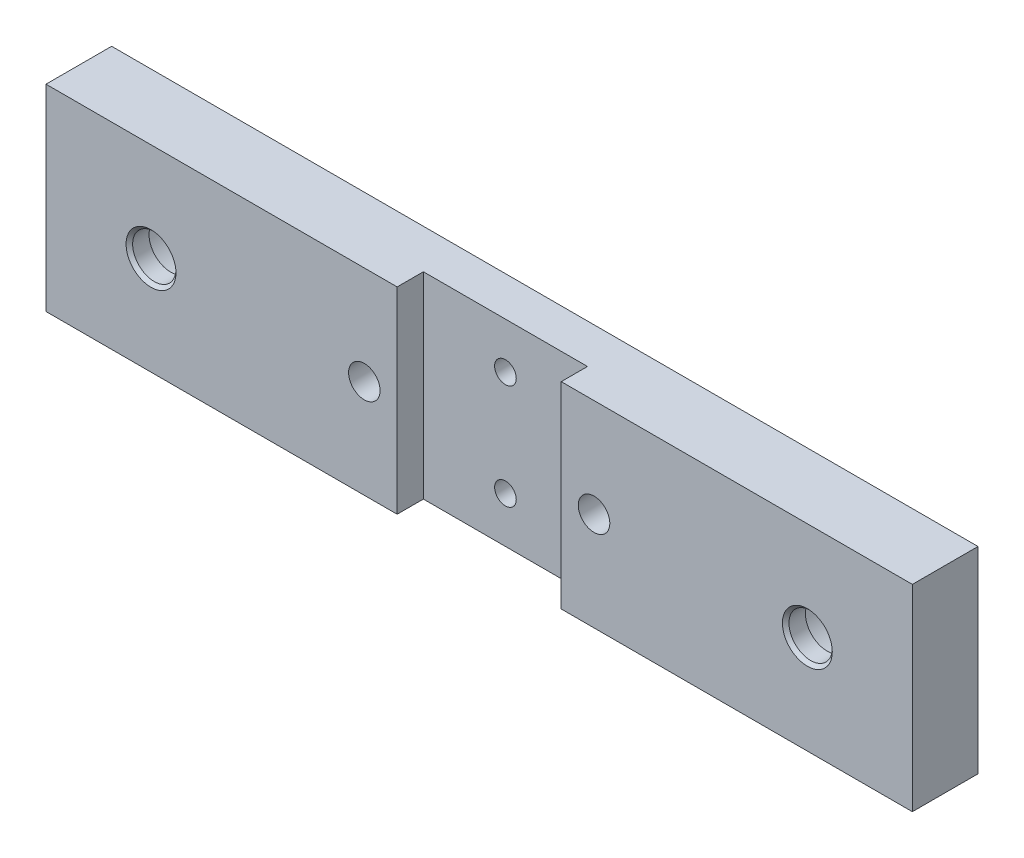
ISO-10303-21;
HEADER;
FILE_DESCRIPTION(('STEP AP214'),'2;1');
FILE_NAME('part.step','',(''),(''),'','','');
FILE_SCHEMA(('AUTOMOTIVE_DESIGN { 1 0 10303 214 1 1 1 1 }'));
ENDSEC;
DATA;
#1=APPLICATION_CONTEXT('core data for automotive mechanical design processes');
#2=APPLICATION_PROTOCOL_DEFINITION('international standard','automotive_design',2000,#1);
#3=PRODUCT_CONTEXT('',#1,'mechanical');
#4=PRODUCT('Part','Part','',(#3));
#5=PRODUCT_RELATED_PRODUCT_CATEGORY('part','',(#4));
#6=PRODUCT_DEFINITION_FORMATION('','',#4);
#7=PRODUCT_DEFINITION_CONTEXT('part definition',#1,'design');
#8=PRODUCT_DEFINITION('design','',#6,#7);
#9=PRODUCT_DEFINITION_SHAPE('','',#8);
#10=(LENGTH_UNIT() NAMED_UNIT(*) SI_UNIT(.MILLI.,.METRE.));
#11=(NAMED_UNIT(*) PLANE_ANGLE_UNIT() SI_UNIT($,.RADIAN.));
#12=(NAMED_UNIT(*) SI_UNIT($,.STERADIAN.) SOLID_ANGLE_UNIT());
#13=UNCERTAINTY_MEASURE_WITH_UNIT(LENGTH_MEASURE(1.E-05),#10,'distance_accuracy_value','');
#14=(GEOMETRIC_REPRESENTATION_CONTEXT(3) GLOBAL_UNCERTAINTY_ASSIGNED_CONTEXT((#13)) GLOBAL_UNIT_ASSIGNED_CONTEXT((#10,
#11,#12)) REPRESENTATION_CONTEXT('',''));
#15=CARTESIAN_POINT('',(0.,0.,0.));
#16=DIRECTION('',(0.,0.,1.));
#17=DIRECTION('',(1.,0.,0.));
#18=AXIS2_PLACEMENT_3D('',#15,#16,#17);
#19=CARTESIAN_POINT('',(-66.,-15.,10.));
#20=DIRECTION('',(0.,0.,1.));
#21=DIRECTION('',(1.,0.,0.));
#22=AXIS2_PLACEMENT_3D('',#19,#20,#21);
#23=PLANE('',#22);
#24=DIRECTION('',(0.,-1.,0.));
#25=VECTOR('',#24,1.);
#26=CARTESIAN_POINT('',(-12.5,-15.,10.));
#27=LINE('',#26,#25);
#28=CARTESIAN_POINT('',(-12.5,15.,10.));
#29=VERTEX_POINT('',#28);
#30=CARTESIAN_POINT('',(-12.5,-15.,10.));
#31=VERTEX_POINT('',#30);
#32=EDGE_CURVE('E103',#29,#31,#27,.T.);
#33=ORIENTED_EDGE('',*,*,#32,.F.);
#34=DIRECTION('',(-1.,0.,0.));
#35=VECTOR('',#34,1.);
#36=CARTESIAN_POINT('',(-66.,15.,10.));
#37=LINE('',#36,#35);
#38=CARTESIAN_POINT('',(-66.,15.,10.));
#39=VERTEX_POINT('',#38);
#40=EDGE_CURVE('E53',#29,#39,#37,.T.);
#41=ORIENTED_EDGE('',*,*,#40,.T.);
#42=DIRECTION('',(0.,-1.,0.));
#43=VECTOR('',#42,1.);
#44=CARTESIAN_POINT('',(-66.,15.,10.));
#45=LINE('',#44,#43);
#46=CARTESIAN_POINT('',(-66.,-15.,10.));
#47=VERTEX_POINT('',#46);
#48=EDGE_CURVE('E214',#39,#47,#45,.T.);
#49=ORIENTED_EDGE('',*,*,#48,.T.);
#50=DIRECTION('',(1.,0.,0.));
#51=VECTOR('',#50,1.);
#52=CARTESIAN_POINT('',(-66.,-15.,10.));
#53=LINE('',#52,#51);
#54=EDGE_CURVE('E216',#47,#31,#53,.T.);
#55=ORIENTED_EDGE('',*,*,#54,.T.);
#56=EDGE_LOOP('',(#33,#41,#49,#55));
#57=FACE_BOUND('',#56,.T.);
#58=CARTESIAN_POINT('',(-50.,0.,10.));
#59=DIRECTION('',(0.,0.,1.));
#60=DIRECTION('',(1.,0.,0.));
#61=AXIS2_PLACEMENT_3D('',#58,#59,#60);
#62=CIRCLE('',#61,3.8);
#63=CARTESIAN_POINT('',(-46.2,0.,10.));
#64=VERTEX_POINT('',#63);
#65=EDGE_CURVE('E137',#64,#64,#62,.F.);
#66=ORIENTED_EDGE('',*,*,#65,.T.);
#67=EDGE_LOOP('',(#66));
#68=FACE_BOUND('',#67,.T.);
#69=CARTESIAN_POINT('',(-17.5,0.,10.));
#70=DIRECTION('',(0.,0.,-1.));
#71=DIRECTION('',(-1.,0.,0.));
#72=AXIS2_PLACEMENT_3D('',#69,#70,#71);
#73=CIRCLE('',#72,2.4);
#74=CARTESIAN_POINT('',(-19.9,0.,10.));
#75=VERTEX_POINT('',#74);
#76=EDGE_CURVE('E158',#75,#75,#73,.T.);
#77=ORIENTED_EDGE('',*,*,#76,.T.);
#78=EDGE_LOOP('',(#77));
#79=FACE_BOUND('',#78,.T.);
#80=ADVANCED_FACE('F28',(#57,#68,#79),#23,.T.);
#81=DIRECTION('',(0.,1.,0.));
#82=VECTOR('',#81,1.);
#83=CARTESIAN_POINT('',(12.5,-15.,10.));
#84=LINE('',#83,#82);
#85=CARTESIAN_POINT('',(12.5,-15.,10.));
#86=VERTEX_POINT('',#85);
#87=CARTESIAN_POINT('',(12.5,15.,10.));
#88=VERTEX_POINT('',#87);
#89=EDGE_CURVE('E95',#86,#88,#84,.T.);
#90=ORIENTED_EDGE('',*,*,#89,.F.);
#91=CARTESIAN_POINT('',(66.,-15.,10.));
#92=VERTEX_POINT('',#91);
#93=EDGE_CURVE('E215',#86,#92,#53,.T.);
#94=ORIENTED_EDGE('',*,*,#93,.T.);
#95=DIRECTION('',(0.,1.,0.));
#96=VECTOR('',#95,1.);
#97=CARTESIAN_POINT('',(66.,15.,10.));
#98=LINE('',#97,#96);
#99=CARTESIAN_POINT('',(66.,15.,10.));
#100=VERTEX_POINT('',#99);
#101=EDGE_CURVE('E119',#92,#100,#98,.T.);
#102=ORIENTED_EDGE('',*,*,#101,.T.);
#103=EDGE_CURVE('E111',#100,#88,#37,.T.);
#104=ORIENTED_EDGE('',*,*,#103,.T.);
#105=EDGE_LOOP('',(#90,#94,#102,#104));
#106=FACE_BOUND('',#105,.T.);
#107=CARTESIAN_POINT('',(50.,0.,10.));
#108=DIRECTION('',(0.,0.,1.));
#109=DIRECTION('',(1.,0.,0.));
#110=AXIS2_PLACEMENT_3D('',#107,#108,#109);
#111=CIRCLE('',#110,3.8);
#112=CARTESIAN_POINT('',(53.8,0.,10.));
#113=VERTEX_POINT('',#112);
#114=EDGE_CURVE('E152',#113,#113,#111,.F.);
#115=ORIENTED_EDGE('',*,*,#114,.T.);
#116=EDGE_LOOP('',(#115));
#117=FACE_BOUND('',#116,.T.);
#118=CARTESIAN_POINT('',(17.5,0.,10.));
#119=DIRECTION('',(0.,0.,-1.));
#120=DIRECTION('',(-1.,0.,0.));
#121=AXIS2_PLACEMENT_3D('',#118,#119,#120);
#122=CIRCLE('',#121,2.4);
#123=CARTESIAN_POINT('',(15.1,0.,10.));
#124=VERTEX_POINT('',#123);
#125=EDGE_CURVE('E175',#124,#124,#122,.T.);
#126=ORIENTED_EDGE('',*,*,#125,.T.);
#127=EDGE_LOOP('',(#126));
#128=FACE_BOUND('',#127,.T.);
#129=ADVANCED_FACE('F116',(#106,#117,#128),#23,.T.);
#130=CARTESIAN_POINT('',(-66.,15.,10.));
#131=DIRECTION('',(1.,0.,0.));
#132=DIRECTION('',(0.,0.,-1.));
#133=AXIS2_PLACEMENT_3D('',#130,#131,#132);
#134=PLANE('',#133);
#135=DIRECTION('',(0.,-1.,0.));
#136=VECTOR('',#135,1.);
#137=CARTESIAN_POINT('',(-66.,15.,0.));
#138=LINE('',#137,#136);
#139=CARTESIAN_POINT('',(-66.,15.,0.));
#140=VERTEX_POINT('',#139);
#141=CARTESIAN_POINT('',(-66.,-15.,0.));
#142=VERTEX_POINT('',#141);
#143=EDGE_CURVE('E205',#140,#142,#138,.T.);
#144=ORIENTED_EDGE('',*,*,#143,.T.);
#145=DIRECTION('',(0.,0.,-1.));
#146=VECTOR('',#145,1.);
#147=CARTESIAN_POINT('',(-66.,-15.,10.));
#148=LINE('',#147,#146);
#149=EDGE_CURVE('E104',#47,#142,#148,.T.);
#150=ORIENTED_EDGE('',*,*,#149,.F.);
#151=ORIENTED_EDGE('',*,*,#48,.F.);
#152=DIRECTION('',(0.,0.,-1.));
#153=VECTOR('',#152,1.);
#154=CARTESIAN_POINT('',(-66.,15.,10.));
#155=LINE('',#154,#153);
#156=EDGE_CURVE('E121',#39,#140,#155,.T.);
#157=ORIENTED_EDGE('',*,*,#156,.T.);
#158=EDGE_LOOP('',(#144,#150,#151,#157));
#159=FACE_BOUND('',#158,.T.);
#160=ADVANCED_FACE('F30',(#159),#134,.F.);
#161=CARTESIAN_POINT('',(-66.,-15.,10.));
#162=DIRECTION('',(0.,1.,0.));
#163=DIRECTION('',(0.,0.,1.));
#164=AXIS2_PLACEMENT_3D('',#161,#162,#163);
#165=PLANE('',#164);
#166=DIRECTION('',(1.,0.,0.));
#167=VECTOR('',#166,1.);
#168=CARTESIAN_POINT('',(-66.,-15.,6.));
#169=LINE('',#168,#167);
#170=CARTESIAN_POINT('',(-12.5,-15.,6.));
#171=VERTEX_POINT('',#170);
#172=CARTESIAN_POINT('',(12.5,-15.,6.));
#173=VERTEX_POINT('',#172);
#174=EDGE_CURVE('E203',#171,#173,#169,.T.);
#175=ORIENTED_EDGE('',*,*,#174,.F.);
#176=DIRECTION('',(0.,0.,1.));
#177=VECTOR('',#176,1.);
#178=CARTESIAN_POINT('',(-12.5,-15.,10.));
#179=LINE('',#178,#177);
#180=EDGE_CURVE('E200',#171,#31,#179,.T.);
#181=ORIENTED_EDGE('',*,*,#180,.T.);
#182=ORIENTED_EDGE('',*,*,#54,.F.);
#183=ORIENTED_EDGE('',*,*,#149,.T.);
#184=DIRECTION('',(1.,0.,0.));
#185=VECTOR('',#184,1.);
#186=CARTESIAN_POINT('',(-66.,-15.,0.));
#187=LINE('',#186,#185);
#188=CARTESIAN_POINT('',(66.,-15.,0.));
#189=VERTEX_POINT('',#188);
#190=EDGE_CURVE('E208',#142,#189,#187,.T.);
#191=ORIENTED_EDGE('',*,*,#190,.T.);
#192=DIRECTION('',(0.,0.,-1.));
#193=VECTOR('',#192,1.);
#194=CARTESIAN_POINT('',(66.,-15.,10.));
#195=LINE('',#194,#193);
#196=EDGE_CURVE('E130',#92,#189,#195,.T.);
#197=ORIENTED_EDGE('',*,*,#196,.F.);
#198=ORIENTED_EDGE('',*,*,#93,.F.);
#199=DIRECTION('',(0.,0.,-1.));
#200=VECTOR('',#199,1.);
#201=CARTESIAN_POINT('',(12.5,-15.,10.));
#202=LINE('',#201,#200);
#203=EDGE_CURVE('E45',#86,#173,#202,.T.);
#204=ORIENTED_EDGE('',*,*,#203,.T.);
#205=EDGE_LOOP('',(#175,#181,#182,#183,#191,#197,#198,#204));
#206=FACE_BOUND('',#205,.T.);
#207=ADVANCED_FACE('F221',(#206),#165,.F.);
#208=CARTESIAN_POINT('',(66.,15.,10.));
#209=DIRECTION('',(-1.,0.,0.));
#210=DIRECTION('',(0.,0.,1.));
#211=AXIS2_PLACEMENT_3D('',#208,#209,#210);
#212=PLANE('',#211);
#213=DIRECTION('',(0.,1.,0.));
#214=VECTOR('',#213,1.);
#215=CARTESIAN_POINT('',(66.,15.,0.));
#216=LINE('',#215,#214);
#217=CARTESIAN_POINT('',(66.,15.,0.));
#218=VERTEX_POINT('',#217);
#219=EDGE_CURVE('E210',#189,#218,#216,.T.);
#220=ORIENTED_EDGE('',*,*,#219,.T.);
#221=DIRECTION('',(0.,0.,-1.));
#222=VECTOR('',#221,1.);
#223=CARTESIAN_POINT('',(66.,15.,10.));
#224=LINE('',#223,#222);
#225=EDGE_CURVE('E124',#100,#218,#224,.T.);
#226=ORIENTED_EDGE('',*,*,#225,.F.);
#227=ORIENTED_EDGE('',*,*,#101,.F.);
#228=ORIENTED_EDGE('',*,*,#196,.T.);
#229=EDGE_LOOP('',(#220,#226,#227,#228));
#230=FACE_BOUND('',#229,.T.);
#231=ADVANCED_FACE('F224',(#230),#212,.F.);
#232=CARTESIAN_POINT('',(-66.,15.,10.));
#233=DIRECTION('',(0.,-1.,0.));
#234=DIRECTION('',(0.,0.,-1.));
#235=AXIS2_PLACEMENT_3D('',#232,#233,#234);
#236=PLANE('',#235);
#237=ORIENTED_EDGE('',*,*,#40,.F.);
#238=DIRECTION('',(0.,0.,-1.));
#239=VECTOR('',#238,1.);
#240=CARTESIAN_POINT('',(-12.5,15.,10.));
#241=LINE('',#240,#239);
#242=CARTESIAN_POINT('',(-12.5,15.,6.));
#243=VERTEX_POINT('',#242);
#244=EDGE_CURVE('E198',#29,#243,#241,.T.);
#245=ORIENTED_EDGE('',*,*,#244,.T.);
#246=DIRECTION('',(-1.,0.,0.));
#247=VECTOR('',#246,1.);
#248=CARTESIAN_POINT('',(-66.,15.,6.));
#249=LINE('',#248,#247);
#250=CARTESIAN_POINT('',(12.5,15.,6.));
#251=VERTEX_POINT('',#250);
#252=EDGE_CURVE('E113',#251,#243,#249,.T.);
#253=ORIENTED_EDGE('',*,*,#252,.F.);
#254=DIRECTION('',(0.,0.,1.));
#255=VECTOR('',#254,1.);
#256=CARTESIAN_POINT('',(12.5,15.,10.));
#257=LINE('',#256,#255);
#258=EDGE_CURVE('E98',#251,#88,#257,.T.);
#259=ORIENTED_EDGE('',*,*,#258,.T.);
#260=ORIENTED_EDGE('',*,*,#103,.F.);
#261=ORIENTED_EDGE('',*,*,#225,.T.);
#262=DIRECTION('',(-1.,0.,0.));
#263=VECTOR('',#262,1.);
#264=CARTESIAN_POINT('',(-66.,15.,0.));
#265=LINE('',#264,#263);
#266=EDGE_CURVE('E212',#218,#140,#265,.T.);
#267=ORIENTED_EDGE('',*,*,#266,.T.);
#268=ORIENTED_EDGE('',*,*,#156,.F.);
#269=EDGE_LOOP('',(#237,#245,#253,#259,#260,#261,#267,#268));
#270=FACE_BOUND('',#269,.T.);
#271=ADVANCED_FACE('F109',(#270),#236,.F.);
#272=CARTESIAN_POINT('',(-66.,-15.,0.));
#273=DIRECTION('',(0.,0.,1.));
#274=DIRECTION('',(1.,0.,0.));
#275=AXIS2_PLACEMENT_3D('',#272,#273,#274);
#276=PLANE('',#275);
#277=CARTESIAN_POINT('',(0.,8.,0.));
#278=DIRECTION('',(0.,0.,-1.));
#279=DIRECTION('',(-1.,0.,0.));
#280=AXIS2_PLACEMENT_3D('',#277,#278,#279);
#281=CIRCLE('',#280,1.64999999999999);
#282=CARTESIAN_POINT('',(-1.64999999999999,8.,0.));
#283=VERTEX_POINT('',#282);
#284=EDGE_CURVE('E170',#283,#283,#281,.T.);
#285=ORIENTED_EDGE('',*,*,#284,.F.);
#286=EDGE_LOOP('',(#285));
#287=FACE_BOUND('',#286,.T.);
#288=CARTESIAN_POINT('',(0.,-8.,0.));
#289=DIRECTION('',(0.,0.,-1.));
#290=DIRECTION('',(-1.,0.,0.));
#291=AXIS2_PLACEMENT_3D('',#288,#289,#290);
#292=CIRCLE('',#291,1.64999999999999);
#293=CARTESIAN_POINT('',(-1.64999999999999,-8.,0.));
#294=VERTEX_POINT('',#293);
#295=EDGE_CURVE('E159',#294,#294,#292,.T.);
#296=ORIENTED_EDGE('',*,*,#295,.F.);
#297=EDGE_LOOP('',(#296));
#298=FACE_BOUND('',#297,.T.);
#299=CARTESIAN_POINT('',(-17.5,0.,0.));
#300=DIRECTION('',(0.,0.,-1.));
#301=DIRECTION('',(-1.,0.,0.));
#302=AXIS2_PLACEMENT_3D('',#299,#300,#301);
#303=CIRCLE('',#302,2.4);
#304=CARTESIAN_POINT('',(-19.9,0.,0.));
#305=VERTEX_POINT('',#304);
#306=EDGE_CURVE('E163',#305,#305,#303,.T.);
#307=ORIENTED_EDGE('',*,*,#306,.F.);
#308=EDGE_LOOP('',(#307));
#309=FACE_BOUND('',#308,.T.);
#310=CARTESIAN_POINT('',(17.5,0.,0.));
#311=DIRECTION('',(0.,0.,-1.));
#312=DIRECTION('',(-1.,0.,0.));
#313=AXIS2_PLACEMENT_3D('',#310,#311,#312);
#314=CIRCLE('',#313,2.4);
#315=CARTESIAN_POINT('',(15.1,0.,0.));
#316=VERTEX_POINT('',#315);
#317=EDGE_CURVE('E178',#316,#316,#314,.T.);
#318=ORIENTED_EDGE('',*,*,#317,.F.);
#319=EDGE_LOOP('',(#318));
#320=FACE_BOUND('',#319,.T.);
#321=CARTESIAN_POINT('',(-50.,0.,0.));
#322=DIRECTION('',(0.,0.,1.));
#323=DIRECTION('',(1.,0.,0.));
#324=AXIS2_PLACEMENT_3D('',#321,#322,#323);
#325=CIRCLE('',#324,6.75);
#326=CARTESIAN_POINT('',(-43.25,0.,0.));
#327=VERTEX_POINT('',#326);
#328=EDGE_CURVE('E149',#327,#327,#325,.T.);
#329=ORIENTED_EDGE('',*,*,#328,.T.);
#330=EDGE_LOOP('',(#329));
#331=FACE_BOUND('',#330,.T.);
#332=CARTESIAN_POINT('',(50.,0.,0.));
#333=DIRECTION('',(0.,0.,1.));
#334=DIRECTION('',(1.,0.,0.));
#335=AXIS2_PLACEMENT_3D('',#332,#333,#334);
#336=CIRCLE('',#335,6.75);
#337=CARTESIAN_POINT('',(56.75,0.,0.));
#338=VERTEX_POINT('',#337);
#339=EDGE_CURVE('E146',#338,#338,#336,.T.);
#340=ORIENTED_EDGE('',*,*,#339,.T.);
#341=EDGE_LOOP('',(#340));
#342=FACE_BOUND('',#341,.T.);
#343=ORIENTED_EDGE('',*,*,#143,.F.);
#344=ORIENTED_EDGE('',*,*,#266,.F.);
#345=ORIENTED_EDGE('',*,*,#219,.F.);
#346=ORIENTED_EDGE('',*,*,#190,.F.);
#347=EDGE_LOOP('',(#343,#344,#345,#346));
#348=FACE_BOUND('',#347,.T.);
#349=ADVANCED_FACE('F228',(#287,#298,#309,#320,#331,#342,#348),#276,.F.);
#350=CARTESIAN_POINT('',(-12.5,-31.9597267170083,6.));
#351=DIRECTION('',(0.,0.,1.));
#352=DIRECTION('',(1.,0.,0.));
#353=AXIS2_PLACEMENT_3D('',#350,#351,#352);
#354=PLANE('',#353);
#355=CARTESIAN_POINT('',(0.,8.,6.));
#356=DIRECTION('',(0.,0.,1.));
#357=DIRECTION('',(1.,0.,0.));
#358=AXIS2_PLACEMENT_3D('',#355,#356,#357);
#359=CIRCLE('',#358,1.64999999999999);
#360=CARTESIAN_POINT('',(1.64999999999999,8.,6.));
#361=VERTEX_POINT('',#360);
#362=EDGE_CURVE('E32',#361,#361,#359,.T.);
#363=ORIENTED_EDGE('',*,*,#362,.F.);
#364=EDGE_LOOP('',(#363));
#365=FACE_BOUND('',#364,.T.);
#366=CARTESIAN_POINT('',(0.,-8.,6.));
#367=DIRECTION('',(0.,0.,1.));
#368=DIRECTION('',(1.,0.,0.));
#369=AXIS2_PLACEMENT_3D('',#366,#367,#368);
#370=CIRCLE('',#369,1.64999999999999);
#371=CARTESIAN_POINT('',(1.64999999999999,-8.,6.));
#372=VERTEX_POINT('',#371);
#373=EDGE_CURVE('E156',#372,#372,#370,.T.);
#374=ORIENTED_EDGE('',*,*,#373,.F.);
#375=EDGE_LOOP('',(#374));
#376=FACE_BOUND('',#375,.T.);
#377=ORIENTED_EDGE('',*,*,#174,.T.);
#378=DIRECTION('',(0.,1.,0.));
#379=VECTOR('',#378,1.);
#380=CARTESIAN_POINT('',(12.5,31.326860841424,6.));
#381=LINE('',#380,#379);
#382=EDGE_CURVE('E114',#173,#251,#381,.T.);
#383=ORIENTED_EDGE('',*,*,#382,.T.);
#384=ORIENTED_EDGE('',*,*,#252,.T.);
#385=DIRECTION('',(0.,-1.,0.));
#386=VECTOR('',#385,1.);
#387=CARTESIAN_POINT('',(-12.5,31.326860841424,6.));
#388=LINE('',#387,#386);
#389=EDGE_CURVE('E193',#243,#171,#388,.T.);
#390=ORIENTED_EDGE('',*,*,#389,.T.);
#391=EDGE_LOOP('',(#377,#383,#384,#390));
#392=FACE_BOUND('',#391,.T.);
#393=ADVANCED_FACE('F252',(#365,#376,#392),#354,.T.);
#394=CARTESIAN_POINT('',(-12.5,31.326860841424,6.));
#395=DIRECTION('',(-1.,0.,0.));
#396=DIRECTION('',(0.,-1.,0.));
#397=AXIS2_PLACEMENT_3D('',#394,#395,#396);
#398=PLANE('',#397);
#399=ORIENTED_EDGE('',*,*,#389,.F.);
#400=ORIENTED_EDGE('',*,*,#244,.F.);
#401=ORIENTED_EDGE('',*,*,#32,.T.);
#402=ORIENTED_EDGE('',*,*,#180,.F.);
#403=EDGE_LOOP('',(#399,#400,#401,#402));
#404=FACE_BOUND('',#403,.T.);
#405=ADVANCED_FACE('F234',(#404),#398,.F.);
#406=CARTESIAN_POINT('',(12.5,31.326860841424,6.));
#407=DIRECTION('',(1.,0.,0.));
#408=DIRECTION('',(0.,1.,0.));
#409=AXIS2_PLACEMENT_3D('',#406,#407,#408);
#410=PLANE('',#409);
#411=ORIENTED_EDGE('',*,*,#89,.T.);
#412=ORIENTED_EDGE('',*,*,#258,.F.);
#413=ORIENTED_EDGE('',*,*,#382,.F.);
#414=ORIENTED_EDGE('',*,*,#203,.F.);
#415=EDGE_LOOP('',(#411,#412,#413,#414));
#416=FACE_BOUND('',#415,.T.);
#417=ADVANCED_FACE('F97',(#416),#410,.F.);
#418=CARTESIAN_POINT('',(50.,0.,0.));
#419=DIRECTION('',(0.,0.,-1.));
#420=DIRECTION('',(-1.,0.,0.));
#421=AXIS2_PLACEMENT_3D('',#418,#419,#420);
#422=CYLINDRICAL_SURFACE('',#421,3.3);
#423=CARTESIAN_POINT('',(50.,0.,9.5));
#424=DIRECTION('',(0.,0.,1.));
#425=DIRECTION('',(1.,0.,0.));
#426=AXIS2_PLACEMENT_3D('',#423,#424,#425);
#427=CIRCLE('',#426,3.3);
#428=CARTESIAN_POINT('',(53.3,0.,9.5));
#429=VERTEX_POINT('',#428);
#430=EDGE_CURVE('E37',#429,#429,#427,.T.);
#431=ORIENTED_EDGE('',*,*,#430,.T.);
#432=EDGE_LOOP('',(#431));
#433=FACE_BOUND('',#432,.T.);
#434=CARTESIAN_POINT('',(50.,0.,7.));
#435=DIRECTION('',(0.,0.,-1.));
#436=DIRECTION('',(-1.,0.,0.));
#437=AXIS2_PLACEMENT_3D('',#434,#435,#436);
#438=CIRCLE('',#437,3.3);
#439=CARTESIAN_POINT('',(46.7,0.,7.));
#440=VERTEX_POINT('',#439);
#441=EDGE_CURVE('E190',#440,#440,#438,.T.);
#442=ORIENTED_EDGE('',*,*,#441,.T.);
#443=EDGE_LOOP('',(#442));
#444=FACE_BOUND('',#443,.T.);
#445=ADVANCED_FACE('F277',(#433,#444),#422,.F.);
#446=CARTESIAN_POINT('',(53.3,0.,7.));
#447=DIRECTION('',(0.,0.,1.));
#448=DIRECTION('',(1.,0.,0.));
#449=AXIS2_PLACEMENT_3D('',#446,#447,#448);
#450=PLANE('',#449);
#451=ORIENTED_EDGE('',*,*,#441,.F.);
#452=EDGE_LOOP('',(#451));
#453=FACE_BOUND('',#452,.T.);
#454=CARTESIAN_POINT('',(50.,0.,7.));
#455=DIRECTION('',(0.,0.,-1.));
#456=DIRECTION('',(-1.,0.,0.));
#457=AXIS2_PLACEMENT_3D('',#454,#455,#456);
#458=CIRCLE('',#457,6.25);
#459=CARTESIAN_POINT('',(43.75,0.,7.));
#460=VERTEX_POINT('',#459);
#461=EDGE_CURVE('E187',#460,#460,#458,.T.);
#462=ORIENTED_EDGE('',*,*,#461,.T.);
#463=EDGE_LOOP('',(#462));
#464=FACE_BOUND('',#463,.T.);
#465=ADVANCED_FACE('F272',(#453,#464),#450,.F.);
#466=CARTESIAN_POINT('',(50.,0.,0.));
#467=DIRECTION('',(0.,0.,-1.));
#468=DIRECTION('',(-1.,0.,0.));
#469=AXIS2_PLACEMENT_3D('',#466,#467,#468);
#470=CYLINDRICAL_SURFACE('',#469,6.25);
#471=CARTESIAN_POINT('',(50.,0.,0.5));
#472=DIRECTION('',(0.,0.,1.));
#473=DIRECTION('',(1.,0.,0.));
#474=AXIS2_PLACEMENT_3D('',#471,#472,#473);
#475=CIRCLE('',#474,6.25);
#476=CARTESIAN_POINT('',(56.25,0.,0.5));
#477=VERTEX_POINT('',#476);
#478=EDGE_CURVE('E11',#477,#477,#475,.F.);
#479=ORIENTED_EDGE('',*,*,#478,.T.);
#480=EDGE_LOOP('',(#479));
#481=FACE_BOUND('',#480,.T.);
#482=ORIENTED_EDGE('',*,*,#461,.F.);
#483=EDGE_LOOP('',(#482));
#484=FACE_BOUND('',#483,.T.);
#485=ADVANCED_FACE('F268',(#481,#484),#470,.F.);
#486=CARTESIAN_POINT('',(-50.,0.,0.));
#487=DIRECTION('',(0.,0.,-1.));
#488=DIRECTION('',(-1.,0.,0.));
#489=AXIS2_PLACEMENT_3D('',#486,#487,#488);
#490=CYLINDRICAL_SURFACE('',#489,3.3);
#491=CARTESIAN_POINT('',(-50.,0.,9.5));
#492=DIRECTION('',(0.,0.,1.));
#493=DIRECTION('',(1.,0.,0.));
#494=AXIS2_PLACEMENT_3D('',#491,#492,#493);
#495=CIRCLE('',#494,3.3);
#496=CARTESIAN_POINT('',(-46.7,0.,9.5));
#497=VERTEX_POINT('',#496);
#498=EDGE_CURVE('E140',#497,#497,#495,.T.);
#499=ORIENTED_EDGE('',*,*,#498,.T.);
#500=EDGE_LOOP('',(#499));
#501=FACE_BOUND('',#500,.T.);
#502=CARTESIAN_POINT('',(-50.,0.,7.));
#503=DIRECTION('',(0.,0.,-1.));
#504=DIRECTION('',(-1.,0.,0.));
#505=AXIS2_PLACEMENT_3D('',#502,#503,#504);
#506=CIRCLE('',#505,3.3);
#507=CARTESIAN_POINT('',(-53.3,0.,7.));
#508=VERTEX_POINT('',#507);
#509=EDGE_CURVE('E184',#508,#508,#506,.T.);
#510=ORIENTED_EDGE('',*,*,#509,.T.);
#511=EDGE_LOOP('',(#510));
#512=FACE_BOUND('',#511,.T.);
#513=ADVANCED_FACE('F271',(#501,#512),#490,.F.);
#514=CARTESIAN_POINT('',(-46.7,0.,7.));
#515=DIRECTION('',(0.,0.,1.));
#516=DIRECTION('',(1.,0.,0.));
#517=AXIS2_PLACEMENT_3D('',#514,#515,#516);
#518=PLANE('',#517);
#519=ORIENTED_EDGE('',*,*,#509,.F.);
#520=EDGE_LOOP('',(#519));
#521=FACE_BOUND('',#520,.T.);
#522=CARTESIAN_POINT('',(-50.,0.,7.));
#523=DIRECTION('',(0.,0.,-1.));
#524=DIRECTION('',(-1.,0.,0.));
#525=AXIS2_PLACEMENT_3D('',#522,#523,#524);
#526=CIRCLE('',#525,6.25);
#527=CARTESIAN_POINT('',(-56.25,0.,7.));
#528=VERTEX_POINT('',#527);
#529=EDGE_CURVE('E181',#528,#528,#526,.T.);
#530=ORIENTED_EDGE('',*,*,#529,.T.);
#531=EDGE_LOOP('',(#530));
#532=FACE_BOUND('',#531,.T.);
#533=ADVANCED_FACE('F362',(#521,#532),#518,.F.);
#534=CARTESIAN_POINT('',(-50.,0.,0.));
#535=DIRECTION('',(0.,0.,-1.));
#536=DIRECTION('',(-1.,0.,0.));
#537=AXIS2_PLACEMENT_3D('',#534,#535,#536);
#538=CYLINDRICAL_SURFACE('',#537,6.25);
#539=CARTESIAN_POINT('',(-50.,0.,0.5));
#540=DIRECTION('',(0.,0.,1.));
#541=DIRECTION('',(1.,0.,0.));
#542=AXIS2_PLACEMENT_3D('',#539,#540,#541);
#543=CIRCLE('',#542,6.25);
#544=CARTESIAN_POINT('',(-43.75,0.,0.5));
#545=VERTEX_POINT('',#544);
#546=EDGE_CURVE('E143',#545,#545,#543,.F.);
#547=ORIENTED_EDGE('',*,*,#546,.T.);
#548=EDGE_LOOP('',(#547));
#549=FACE_BOUND('',#548,.T.);
#550=ORIENTED_EDGE('',*,*,#529,.F.);
#551=EDGE_LOOP('',(#550));
#552=FACE_BOUND('',#551,.T.);
#553=ADVANCED_FACE('F352',(#549,#552),#538,.F.);
#554=CARTESIAN_POINT('',(-50.,0.,10.));
#555=DIRECTION('',(0.,0.,1.));
#556=DIRECTION('',(1.,0.,0.));
#557=AXIS2_PLACEMENT_3D('',#554,#555,#556);
#558=CONICAL_SURFACE('',#557,3.8,0.785398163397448);
#559=ORIENTED_EDGE('',*,*,#498,.F.);
#560=EDGE_LOOP('',(#559));
#561=FACE_BOUND('',#560,.T.);
#562=ORIENTED_EDGE('',*,*,#65,.F.);
#563=EDGE_LOOP('',(#562));
#564=FACE_BOUND('',#563,.T.);
#565=ADVANCED_FACE('F342',(#561,#564),#558,.F.);
#566=CARTESIAN_POINT('',(-50.,0.,0.5));
#567=DIRECTION('',(0.,0.,-1.));
#568=DIRECTION('',(-1.,0.,0.));
#569=AXIS2_PLACEMENT_3D('',#566,#567,#568);
#570=CONICAL_SURFACE('',#569,6.25,0.785398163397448);
#571=ORIENTED_EDGE('',*,*,#328,.F.);
#572=EDGE_LOOP('',(#571));
#573=FACE_BOUND('',#572,.T.);
#574=ORIENTED_EDGE('',*,*,#546,.F.);
#575=EDGE_LOOP('',(#574));
#576=FACE_BOUND('',#575,.T.);
#577=ADVANCED_FACE('F332',(#573,#576),#570,.F.);
#578=CARTESIAN_POINT('',(50.,0.,10.));
#579=DIRECTION('',(0.,0.,1.));
#580=DIRECTION('',(1.,0.,0.));
#581=AXIS2_PLACEMENT_3D('',#578,#579,#580);
#582=CONICAL_SURFACE('',#581,3.8,0.785398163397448);
#583=ORIENTED_EDGE('',*,*,#430,.F.);
#584=EDGE_LOOP('',(#583));
#585=FACE_BOUND('',#584,.T.);
#586=ORIENTED_EDGE('',*,*,#114,.F.);
#587=EDGE_LOOP('',(#586));
#588=FACE_BOUND('',#587,.T.);
#589=ADVANCED_FACE('F264',(#585,#588),#582,.F.);
#590=CARTESIAN_POINT('',(50.,0.,0.5));
#591=DIRECTION('',(0.,0.,-1.));
#592=DIRECTION('',(-1.,0.,0.));
#593=AXIS2_PLACEMENT_3D('',#590,#591,#592);
#594=CONICAL_SURFACE('',#593,6.25,0.785398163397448);
#595=ORIENTED_EDGE('',*,*,#339,.F.);
#596=EDGE_LOOP('',(#595));
#597=FACE_BOUND('',#596,.T.);
#598=ORIENTED_EDGE('',*,*,#478,.F.);
#599=EDGE_LOOP('',(#598));
#600=FACE_BOUND('',#599,.T.);
#601=ADVANCED_FACE('F261',(#597,#600),#594,.F.);
#602=CARTESIAN_POINT('',(17.5,0.,0.));
#603=DIRECTION('',(0.,0.,-1.));
#604=DIRECTION('',(-1.,0.,0.));
#605=AXIS2_PLACEMENT_3D('',#602,#603,#604);
#606=CYLINDRICAL_SURFACE('',#605,2.4);
#607=ORIENTED_EDGE('',*,*,#125,.F.);
#608=EDGE_LOOP('',(#607));
#609=FACE_BOUND('',#608,.T.);
#610=ORIENTED_EDGE('',*,*,#317,.T.);
#611=EDGE_LOOP('',(#610));
#612=FACE_BOUND('',#611,.T.);
#613=ADVANCED_FACE('F246',(#609,#612),#606,.F.);
#614=CARTESIAN_POINT('',(-17.5,0.,0.));
#615=DIRECTION('',(0.,0.,-1.));
#616=DIRECTION('',(-1.,0.,0.));
#617=AXIS2_PLACEMENT_3D('',#614,#615,#616);
#618=CYLINDRICAL_SURFACE('',#617,2.4);
#619=ORIENTED_EDGE('',*,*,#76,.F.);
#620=EDGE_LOOP('',(#619));
#621=FACE_BOUND('',#620,.T.);
#622=ORIENTED_EDGE('',*,*,#306,.T.);
#623=EDGE_LOOP('',(#622));
#624=FACE_BOUND('',#623,.T.);
#625=ADVANCED_FACE('F242',(#621,#624),#618,.F.);
#626=CARTESIAN_POINT('',(0.,-8.,0.));
#627=DIRECTION('',(0.,0.,-1.));
#628=DIRECTION('',(-1.,0.,0.));
#629=AXIS2_PLACEMENT_3D('',#626,#627,#628);
#630=CYLINDRICAL_SURFACE('',#629,1.64999999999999);
#631=ORIENTED_EDGE('',*,*,#373,.T.);
#632=EDGE_LOOP('',(#631));
#633=FACE_BOUND('',#632,.T.);
#634=ORIENTED_EDGE('',*,*,#295,.T.);
#635=EDGE_LOOP('',(#634));
#636=FACE_BOUND('',#635,.T.);
#637=ADVANCED_FACE('F245',(#633,#636),#630,.F.);
#638=CARTESIAN_POINT('',(0.,8.,0.));
#639=DIRECTION('',(0.,0.,-1.));
#640=DIRECTION('',(-1.,0.,0.));
#641=AXIS2_PLACEMENT_3D('',#638,#639,#640);
#642=CYLINDRICAL_SURFACE('',#641,1.64999999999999);
#643=ORIENTED_EDGE('',*,*,#362,.T.);
#644=EDGE_LOOP('',(#643));
#645=FACE_BOUND('',#644,.T.);
#646=ORIENTED_EDGE('',*,*,#284,.T.);
#647=EDGE_LOOP('',(#646));
#648=FACE_BOUND('',#647,.T.);
#649=ADVANCED_FACE('F445',(#645,#648),#642,.F.);
#650=CLOSED_SHELL('',(#80,#129,#160,#207,#231,#271,#349,#393,#405,#417,#445,#465,#485,#513,#533,
#553,#565,#577,#589,#601,#613,#625,#637,#649));
#651=MANIFOLD_SOLID_BREP('B2',#650);
#652=ADVANCED_BREP_SHAPE_REPRESENTATION('',(#18,#651),#14);
#653=SHAPE_DEFINITION_REPRESENTATION(#9,#652);
ENDSEC;
END-ISO-10303-21;
